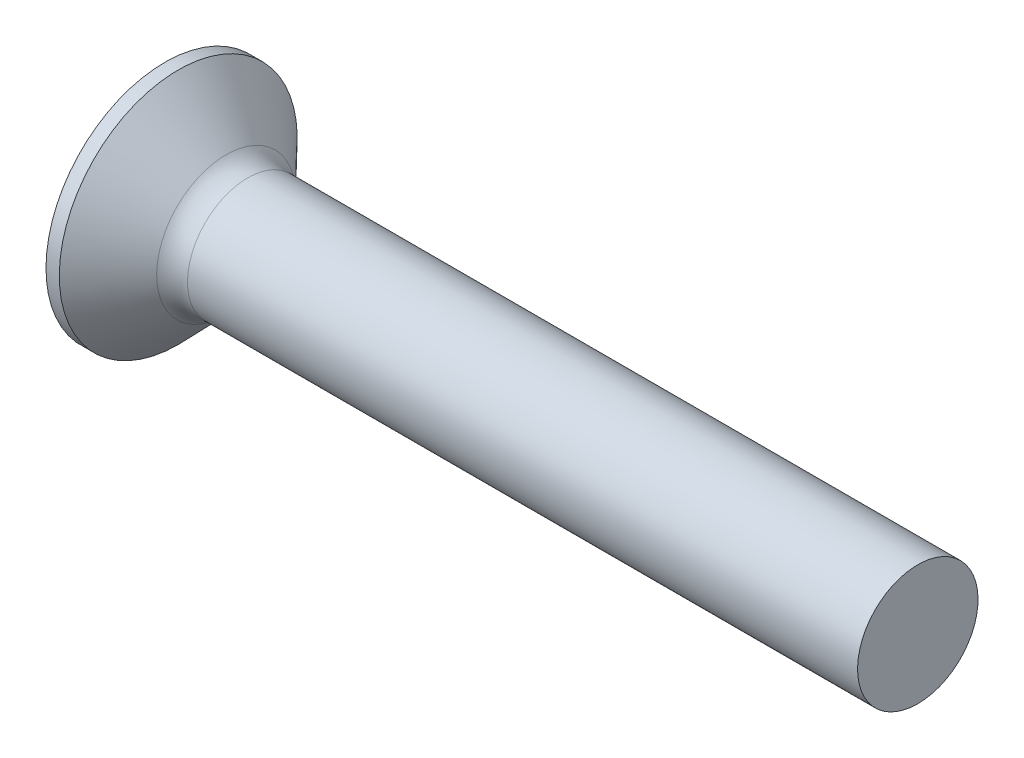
ISO-10303-21;
HEADER;
FILE_DESCRIPTION(('STEP AP214'),'2;1');
FILE_NAME('part.step','',(''),(''),'','','');
FILE_SCHEMA(('AUTOMOTIVE_DESIGN { 1 0 10303 214 1 1 1 1 }'));
ENDSEC;
DATA;
#1=APPLICATION_CONTEXT('core data for automotive mechanical design processes');
#2=APPLICATION_PROTOCOL_DEFINITION('international standard','automotive_design',2000,#1);
#3=PRODUCT_CONTEXT('',#1,'mechanical');
#4=PRODUCT('Part','Part','',(#3));
#5=PRODUCT_RELATED_PRODUCT_CATEGORY('part','',(#4));
#6=PRODUCT_DEFINITION_FORMATION('','',#4);
#7=PRODUCT_DEFINITION_CONTEXT('part definition',#1,'design');
#8=PRODUCT_DEFINITION('design','',#6,#7);
#9=PRODUCT_DEFINITION_SHAPE('','',#8);
#10=(LENGTH_UNIT() NAMED_UNIT(*) SI_UNIT(.MILLI.,.METRE.));
#11=(NAMED_UNIT(*) PLANE_ANGLE_UNIT() SI_UNIT($,.RADIAN.));
#12=(NAMED_UNIT(*) SI_UNIT($,.STERADIAN.) SOLID_ANGLE_UNIT());
#13=UNCERTAINTY_MEASURE_WITH_UNIT(LENGTH_MEASURE(1.E-05),#10,'distance_accuracy_value','');
#14=(GEOMETRIC_REPRESENTATION_CONTEXT(3) GLOBAL_UNCERTAINTY_ASSIGNED_CONTEXT((#13)) GLOBAL_UNIT_ASSIGNED_CONTEXT((#10,
#11,#12)) REPRESENTATION_CONTEXT('',''));
#15=CARTESIAN_POINT('',(0.,0.,0.));
#16=DIRECTION('',(0.,0.,1.));
#17=DIRECTION('',(1.,0.,0.));
#18=AXIS2_PLACEMENT_3D('',#15,#16,#17);
#19=CARTESIAN_POINT('',(16.5,0.,0.));
#20=DIRECTION('',(-1.,0.,0.));
#21=DIRECTION('',(0.,1.,0.));
#22=AXIS2_PLACEMENT_3D('',#19,#20,#21);
#23=SPHERICAL_SURFACE('',#22,16.5);
#24=CARTESIAN_POINT('',(2.01414483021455,0.,0.));
#25=DIRECTION('',(-1.,0.,0.));
#26=DIRECTION('',(0.,-1.,0.));
#27=AXIS2_PLACEMENT_3D('',#24,#25,#26);
#28=CIRCLE('',#27,7.9);
#29=CARTESIAN_POINT('',(2.01414483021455,-7.9,0.));
#30=VERTEX_POINT('',#29);
#31=EDGE_CURVE('E709',#30,#30,#28,.T.);
#32=ORIENTED_EDGE('',*,*,#31,.T.);
#33=EDGE_LOOP('',(#32));
#34=FACE_BOUND('',#33,.T.);
#35=CARTESIAN_POINT('',(0.130621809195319,0.,0.));
#36=DIRECTION('',(1.,0.,0.));
#37=DIRECTION('',(0.,0.,-1.));
#38=AXIS2_PLACEMENT_3D('',#35,#36,#37);
#39=CIRCLE('',#38,2.07206603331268);
#40=CARTESIAN_POINT('',(0.130621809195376,-0.945999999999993,-1.84351339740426));
#41=VERTEX_POINT('',#40);
#42=CARTESIAN_POINT('',(0.130621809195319,-1.84351339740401,-0.946));
#43=VERTEX_POINT('',#42);
#44=EDGE_CURVE('E486',#41,#43,#39,.F.);
#45=ORIENTED_EDGE('',*,*,#44,.F.);
#46=CARTESIAN_POINT('',(16.5,-0.946,0.));
#47=DIRECTION('',(0.,1.,0.));
#48=DIRECTION('',(0.,0.,1.));
#49=AXIS2_PLACEMENT_3D('',#46,#47,#48);
#50=CIRCLE('',#49,16.4728590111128);
#51=CARTESIAN_POINT('',(0.529252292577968,-0.945999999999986,-4.0361245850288));
#52=VERTEX_POINT('',#51);
#53=EDGE_CURVE('E683',#52,#41,#50,.T.);
#54=ORIENTED_EDGE('',*,*,#53,.F.);
#55=CARTESIAN_POINT('',(14.932040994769,0.,3.14483976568));
#56=DIRECTION('',(-0.446197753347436,0.,0.894934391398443));
#57=DIRECTION('',(0.894934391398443,0.,0.446197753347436));
#58=AXIS2_PLACEMENT_3D('',#55,#56,#57);
#59=CIRCLE('',#58,16.1214604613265);
#60=CARTESIAN_POINT('',(0.529252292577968,0.946000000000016,-4.03612458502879));
#61=VERTEX_POINT('',#60);
#62=EDGE_CURVE('E61',#61,#52,#59,.T.);
#63=ORIENTED_EDGE('',*,*,#62,.F.);
#64=CARTESIAN_POINT('',(16.5,0.945999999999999,0.));
#65=DIRECTION('',(0.,-1.,0.));
#66=DIRECTION('',(0.,0.,-1.));
#67=AXIS2_PLACEMENT_3D('',#64,#65,#66);
#68=CIRCLE('',#67,16.4728590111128);
#69=CARTESIAN_POINT('',(0.130621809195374,0.946000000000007,-1.84351339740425));
#70=VERTEX_POINT('',#69);
#71=EDGE_CURVE('E594',#70,#61,#68,.T.);
#72=ORIENTED_EDGE('',*,*,#71,.F.);
#73=CARTESIAN_POINT('',(0.130621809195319,1.84351339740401,-0.946));
#74=VERTEX_POINT('',#73);
#75=EDGE_CURVE('E739',#74,#70,#39,.F.);
#76=ORIENTED_EDGE('',*,*,#75,.F.);
#77=CARTESIAN_POINT('',(16.5,0.,-0.945999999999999));
#78=DIRECTION('',(0.,0.,1.));
#79=DIRECTION('',(0.,-1.,0.));
#80=AXIS2_PLACEMENT_3D('',#77,#78,#79);
#81=CIRCLE('',#80,16.4728590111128);
#82=CARTESIAN_POINT('',(0.529252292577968,4.03612458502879,-0.945999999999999));
#83=VERTEX_POINT('',#82);
#84=EDGE_CURVE('E720',#83,#74,#81,.T.);
#85=ORIENTED_EDGE('',*,*,#84,.F.);
#86=CARTESIAN_POINT('',(14.932040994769,-3.14483976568,0.));
#87=DIRECTION('',(-0.446197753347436,-0.894934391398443,0.));
#88=DIRECTION('',(0.894934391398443,-0.446197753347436,0.));
#89=AXIS2_PLACEMENT_3D('',#86,#87,#88);
#90=CIRCLE('',#89,16.1214604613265);
#91=CARTESIAN_POINT('',(0.529252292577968,4.03612458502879,0.946));
#92=VERTEX_POINT('',#91);
#93=EDGE_CURVE('E717',#92,#83,#90,.T.);
#94=ORIENTED_EDGE('',*,*,#93,.F.);
#95=CARTESIAN_POINT('',(16.5,0.,0.946));
#96=DIRECTION('',(0.,0.,-1.));
#97=DIRECTION('',(0.,1.,0.));
#98=AXIS2_PLACEMENT_3D('',#95,#96,#97);
#99=CIRCLE('',#98,16.4728590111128);
#100=CARTESIAN_POINT('',(0.130621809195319,1.84351339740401,0.946));
#101=VERTEX_POINT('',#100);
#102=EDGE_CURVE('E77',#101,#92,#99,.T.);
#103=ORIENTED_EDGE('',*,*,#102,.F.);
#104=CARTESIAN_POINT('',(0.130621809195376,0.945999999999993,1.84351339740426));
#105=VERTEX_POINT('',#104);
#106=EDGE_CURVE('E485',#105,#101,#39,.F.);
#107=ORIENTED_EDGE('',*,*,#106,.F.);
#108=CARTESIAN_POINT('',(0.529252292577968,0.945999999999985,4.0361245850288));
#109=VERTEX_POINT('',#108);
#110=EDGE_CURVE('E687',#109,#105,#68,.T.);
#111=ORIENTED_EDGE('',*,*,#110,.F.);
#112=CARTESIAN_POINT('',(14.932040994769,0.,-3.14483976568));
#113=DIRECTION('',(-0.446197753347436,0.,-0.894934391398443));
#114=DIRECTION('',(-0.894934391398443,0.,0.446197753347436));
#115=AXIS2_PLACEMENT_3D('',#112,#113,#114);
#116=CIRCLE('',#115,16.1214604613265);
#117=CARTESIAN_POINT('',(0.529252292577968,-0.946000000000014,4.03612458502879));
#118=VERTEX_POINT('',#117);
#119=EDGE_CURVE('E679',#118,#109,#116,.T.);
#120=ORIENTED_EDGE('',*,*,#119,.F.);
#121=CARTESIAN_POINT('',(0.130621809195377,-0.946000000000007,1.84351339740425));
#122=VERTEX_POINT('',#121);
#123=EDGE_CURVE('E686',#122,#118,#50,.T.);
#124=ORIENTED_EDGE('',*,*,#123,.F.);
#125=CARTESIAN_POINT('',(0.130621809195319,-1.84351339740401,0.946));
#126=VERTEX_POINT('',#125);
#127=EDGE_CURVE('E480',#126,#122,#39,.F.);
#128=ORIENTED_EDGE('',*,*,#127,.F.);
#129=CARTESIAN_POINT('',(0.529252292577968,-4.03612458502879,0.946));
#130=VERTEX_POINT('',#129);
#131=EDGE_CURVE('E723',#130,#126,#99,.T.);
#132=ORIENTED_EDGE('',*,*,#131,.F.);
#133=CARTESIAN_POINT('',(14.932040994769,3.14483976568,0.));
#134=DIRECTION('',(-0.446197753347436,0.894934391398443,0.));
#135=DIRECTION('',(-0.894934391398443,-0.446197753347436,0.));
#136=AXIS2_PLACEMENT_3D('',#133,#134,#135);
#137=CIRCLE('',#136,16.1214604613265);
#138=CARTESIAN_POINT('',(0.529252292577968,-4.03612458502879,-0.946000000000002));
#139=VERTEX_POINT('',#138);
#140=EDGE_CURVE('E725',#139,#130,#137,.T.);
#141=ORIENTED_EDGE('',*,*,#140,.F.);
#142=EDGE_CURVE('E719',#43,#139,#81,.T.);
#143=ORIENTED_EDGE('',*,*,#142,.F.);
#144=EDGE_LOOP('',(#45,#54,#63,#72,#76,#85,#94,#103,#107,#111,#120,#124,#128,#132,#141,#143));
#145=FACE_BOUND('',#144,.T.);
#146=ADVANCED_FACE('F51',(#34,#145),#23,.T.);
#147=CARTESIAN_POINT('',(0.,-4.3,0.946));
#148=DIRECTION('',(0.,0.,-1.));
#149=DIRECTION('',(0.,1.,0.));
#150=AXIS2_PLACEMENT_3D('',#147,#148,#149);
#151=PLANE('',#150);
#152=ORIENTED_EDGE('',*,*,#131,.T.);
#153=CARTESIAN_POINT('',(0.0541017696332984,-1.84952553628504,0.946));
#154=CARTESIAN_POINT('',(0.699431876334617,-1.7988175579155,0.946));
#155=CARTESIAN_POINT('',(1.34473222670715,-1.7477208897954,0.946));
#156=CARTESIAN_POINT('',(2.63524109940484,-1.64440464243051,0.946));
#157=CARTESIAN_POINT('',(3.28044962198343,-1.59218506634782,0.946));
#158=CARTESIAN_POINT('',(4.13471195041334,-1.52206699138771,0.946));
#159=CARTESIAN_POINT('',(4.34381968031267,-1.50482570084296,0.946));
#160=CARTESIAN_POINT('',(4.76202095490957,-1.47016967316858,0.946));
#161=CARTESIAN_POINT('',(4.97111449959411,-1.45275493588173,0.946));
#162=CARTESIAN_POINT('',(5.1802,-1.43524392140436,0.946));
#163=B_SPLINE_CURVE_WITH_KNOTS('',3,(#153,#154,#155,#156,#157,#158,#159,#160,#161,#162),
.UNSPECIFIED.,.F.,.F.,(4,2,2,2,4),(0.,1.94195898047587,3.8839124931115,4.51336436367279,
5.14281680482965),.UNSPECIFIED.);
#164=CARTESIAN_POINT('',(5.18,-1.43526067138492,0.946));
#165=VERTEX_POINT('',#164);
#166=EDGE_CURVE('E478',#126,#165,#163,.T.);
#167=ORIENTED_EDGE('',*,*,#166,.T.);
#168=DIRECTION('',(0.,-1.,0.));
#169=VECTOR('',#168,1.);
#170=CARTESIAN_POINT('',(5.18,1.71734770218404,0.946));
#171=LINE('',#170,#169);
#172=CARTESIAN_POINT('',(5.18,-1.71734770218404,0.946));
#173=VERTEX_POINT('',#172);
#174=EDGE_CURVE('E430',#165,#173,#171,.T.);
#175=ORIENTED_EDGE('',*,*,#174,.T.);
#176=DIRECTION('',(0.894934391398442,0.446197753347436,0.));
#177=VECTOR('',#176,1.);
#178=CARTESIAN_POINT('',(0.,-4.3,0.946));
#179=LINE('',#178,#177);
#180=EDGE_CURVE('E699',#130,#173,#179,.T.);
#181=ORIENTED_EDGE('',*,*,#180,.F.);
#182=EDGE_LOOP('',(#152,#167,#175,#181));
#183=FACE_BOUND('',#182,.T.);
#184=ADVANCED_FACE('F208',(#183),#151,.T.);
#185=CARTESIAN_POINT('',(5.18,1.71734770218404,0.946));
#186=VERTEX_POINT('',#185);
#187=CARTESIAN_POINT('',(5.18,1.43526067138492,0.946));
#188=VERTEX_POINT('',#187);
#189=EDGE_CURVE('E445',#186,#188,#171,.T.);
#190=ORIENTED_EDGE('',*,*,#189,.T.);
#191=CARTESIAN_POINT('',(5.1802,1.43524392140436,0.946));
#192=CARTESIAN_POINT('',(4.64644015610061,1.47993054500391,0.946));
#193=CARTESIAN_POINT('',(4.11263086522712,1.52402131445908,0.946));
#194=CARTESIAN_POINT('',(3.04493385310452,1.61123082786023,0.946));
#195=CARTESIAN_POINT('',(2.51104613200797,1.65434957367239,0.946));
#196=CARTESIAN_POINT('',(1.656644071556,1.72274853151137,0.946));
#197=CARTESIAN_POINT('',(1.33614892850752,1.74826932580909,0.946));
#198=CARTESIAN_POINT('',(0.695139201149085,1.79907030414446,0.946));
#199=CARTESIAN_POINT('',(0.374624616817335,1.824350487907,0.946));
#200=CARTESIAN_POINT('',(0.0541017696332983,1.84952553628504,0.946));
#201=B_SPLINE_CURVE_WITH_KNOTS('',3,(#191,#192,#193,#194,#195,#196,#197,#198,#199,#200),
.UNSPECIFIED.,.F.,.F.,(4,2,2,2,4),(0.,1.60688056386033,3.21375804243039,4.1782868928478,
5.14281684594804),.UNSPECIFIED.);
#202=EDGE_CURVE('E746',#188,#101,#201,.T.);
#203=ORIENTED_EDGE('',*,*,#202,.T.);
#204=ORIENTED_EDGE('',*,*,#102,.T.);
#205=DIRECTION('',(0.894934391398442,-0.446197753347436,0.));
#206=VECTOR('',#205,1.);
#207=CARTESIAN_POINT('',(0.,4.3,0.946));
#208=LINE('',#207,#206);
#209=EDGE_CURVE('E697',#92,#186,#208,.T.);
#210=ORIENTED_EDGE('',*,*,#209,.T.);
#211=EDGE_LOOP('',(#190,#203,#204,#210));
#212=FACE_BOUND('',#211,.T.);
#213=ADVANCED_FACE('F213',(#212),#151,.T.);
#214=CARTESIAN_POINT('',(0.,4.3,-0.945999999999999));
#215=DIRECTION('',(0.,0.,1.));
#216=DIRECTION('',(0.,-1.,0.));
#217=AXIS2_PLACEMENT_3D('',#214,#215,#216);
#218=PLANE('',#217);
#219=DIRECTION('',(0.,1.,0.));
#220=VECTOR('',#219,1.);
#221=CARTESIAN_POINT('',(5.18,1.71734770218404,-0.945999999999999));
#222=LINE('',#221,#220);
#223=CARTESIAN_POINT('',(5.18,-1.71734770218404,-0.945999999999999));
#224=VERTEX_POINT('',#223);
#225=CARTESIAN_POINT('',(5.18,-1.43526067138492,-0.945999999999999));
#226=VERTEX_POINT('',#225);
#227=EDGE_CURVE('E632',#224,#226,#222,.T.);
#228=ORIENTED_EDGE('',*,*,#227,.T.);
#229=CARTESIAN_POINT('',(5.1802,-1.43524392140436,-0.946));
#230=CARTESIAN_POINT('',(4.64644015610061,-1.47993054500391,-0.946));
#231=CARTESIAN_POINT('',(4.11263086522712,-1.52402131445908,-0.946));
#232=CARTESIAN_POINT('',(3.04493385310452,-1.61123082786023,-0.946));
#233=CARTESIAN_POINT('',(2.51104613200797,-1.65434957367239,-0.946));
#234=CARTESIAN_POINT('',(1.656644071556,-1.72274853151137,-0.946));
#235=CARTESIAN_POINT('',(1.33614892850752,-1.74826932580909,-0.946));
#236=CARTESIAN_POINT('',(0.695139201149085,-1.79907030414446,-0.946));
#237=CARTESIAN_POINT('',(0.374624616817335,-1.824350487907,-0.946));
#238=CARTESIAN_POINT('',(0.0541017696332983,-1.84952553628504,-0.946));
#239=B_SPLINE_CURVE_WITH_KNOTS('',3,(#229,#230,#231,#232,#233,#234,#235,#236,#237,#238),
.UNSPECIFIED.,.F.,.F.,(4,2,2,2,4),(0.,1.60688056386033,3.21375804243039,4.1782868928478,
5.14281684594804),.UNSPECIFIED.);
#240=EDGE_CURVE('E509',#226,#43,#239,.T.);
#241=ORIENTED_EDGE('',*,*,#240,.T.);
#242=ORIENTED_EDGE('',*,*,#142,.T.);
#243=DIRECTION('',(0.894934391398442,0.446197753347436,0.));
#244=VECTOR('',#243,1.);
#245=CARTESIAN_POINT('',(0.,-4.3,-0.946000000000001));
#246=LINE('',#245,#244);
#247=EDGE_CURVE('E696',#139,#224,#246,.T.);
#248=ORIENTED_EDGE('',*,*,#247,.T.);
#249=EDGE_LOOP('',(#228,#241,#242,#248));
#250=FACE_BOUND('',#249,.T.);
#251=ADVANCED_FACE('F520',(#250),#218,.T.);
#252=ORIENTED_EDGE('',*,*,#84,.T.);
#253=CARTESIAN_POINT('',(0.0541017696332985,1.84952553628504,-0.946));
#254=CARTESIAN_POINT('',(0.699431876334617,1.7988175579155,-0.946));
#255=CARTESIAN_POINT('',(1.34473222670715,1.7477208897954,-0.946));
#256=CARTESIAN_POINT('',(2.63524109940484,1.64440464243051,-0.946));
#257=CARTESIAN_POINT('',(3.28044962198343,1.59218506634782,-0.946));
#258=CARTESIAN_POINT('',(4.13471195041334,1.52206699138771,-0.946));
#259=CARTESIAN_POINT('',(4.34381968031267,1.50482570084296,-0.946));
#260=CARTESIAN_POINT('',(4.76202095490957,1.47016967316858,-0.946));
#261=CARTESIAN_POINT('',(4.97111449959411,1.45275493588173,-0.946));
#262=CARTESIAN_POINT('',(5.1802,1.43524392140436,-0.945999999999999));
#263=B_SPLINE_CURVE_WITH_KNOTS('',3,(#253,#254,#255,#256,#257,#258,#259,#260,#261,#262),
.UNSPECIFIED.,.F.,.F.,(4,2,2,2,4),(0.,1.94195898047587,3.8839124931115,4.51336436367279,
5.14281680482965),.UNSPECIFIED.);
#264=CARTESIAN_POINT('',(5.18,1.43526067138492,-0.945999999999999));
#265=VERTEX_POINT('',#264);
#266=EDGE_CURVE('E536',#74,#265,#263,.T.);
#267=ORIENTED_EDGE('',*,*,#266,.T.);
#268=CARTESIAN_POINT('',(5.18,1.71734770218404,-0.945999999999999));
#269=VERTEX_POINT('',#268);
#270=EDGE_CURVE('E634',#265,#269,#222,.T.);
#271=ORIENTED_EDGE('',*,*,#270,.T.);
#272=DIRECTION('',(0.894934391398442,-0.446197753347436,0.));
#273=VECTOR('',#272,1.);
#274=CARTESIAN_POINT('',(0.,4.3,-0.945999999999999));
#275=LINE('',#274,#273);
#276=EDGE_CURVE('E693',#83,#269,#275,.T.);
#277=ORIENTED_EDGE('',*,*,#276,.F.);
#278=EDGE_LOOP('',(#252,#267,#271,#277));
#279=FACE_BOUND('',#278,.T.);
#280=ADVANCED_FACE('F396',(#279),#218,.T.);
#281=CARTESIAN_POINT('',(0.,-4.3,-0.946));
#282=DIRECTION('',(-0.446197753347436,0.894934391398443,0.));
#283=DIRECTION('',(-0.894934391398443,-0.446197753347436,0.));
#284=AXIS2_PLACEMENT_3D('',#281,#282,#283);
#285=PLANE('',#284);
#286=DIRECTION('',(0.,0.,-1.));
#287=VECTOR('',#286,1.);
#288=CARTESIAN_POINT('',(5.18,-1.71734770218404,0.946));
#289=LINE('',#288,#287);
#290=CARTESIAN_POINT('',(5.18,-1.71734770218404,0.0748736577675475));
#291=VERTEX_POINT('',#290);
#292=EDGE_CURVE('E642',#173,#291,#289,.T.);
#293=ORIENTED_EDGE('',*,*,#292,.T.);
#294=CARTESIAN_POINT('',(5.18,0.,0.));
#295=DIRECTION('',(-1.,0.,0.));
#296=DIRECTION('',(0.,-0.999050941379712,-0.0435570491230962));
#297=AXIS2_PLACEMENT_3D('',#294,#295,#296);
#298=CIRCLE('',#297,1.71897911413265);
#299=CARTESIAN_POINT('',(5.18,-1.71734770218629,-0.0748736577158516));
#300=VERTEX_POINT('',#299);
#301=EDGE_CURVE('E378',#300,#291,#298,.T.);
#302=ORIENTED_EDGE('',*,*,#301,.F.);
#303=EDGE_CURVE('E418',#300,#224,#289,.T.);
#304=ORIENTED_EDGE('',*,*,#303,.T.);
#305=ORIENTED_EDGE('',*,*,#247,.F.);
#306=ORIENTED_EDGE('',*,*,#140,.T.);
#307=ORIENTED_EDGE('',*,*,#180,.T.);
#308=EDGE_LOOP('',(#293,#302,#304,#305,#306,#307));
#309=FACE_BOUND('',#308,.T.);
#310=ADVANCED_FACE('F387',(#309),#285,.T.);
#311=CARTESIAN_POINT('',(5.18,1.71734770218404,0.946));
#312=DIRECTION('',(-0.446197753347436,-0.894934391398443,0.));
#313=DIRECTION('',(0.894934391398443,-0.446197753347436,0.));
#314=AXIS2_PLACEMENT_3D('',#311,#312,#313);
#315=PLANE('',#314);
#316=DIRECTION('',(0.,0.,1.));
#317=VECTOR('',#316,1.);
#318=CARTESIAN_POINT('',(5.18,1.71734770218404,0.946));
#319=LINE('',#318,#317);
#320=CARTESIAN_POINT('',(5.18,1.71734770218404,-0.0748736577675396));
#321=VERTEX_POINT('',#320);
#322=EDGE_CURVE('E643',#269,#321,#319,.T.);
#323=ORIENTED_EDGE('',*,*,#322,.T.);
#324=CARTESIAN_POINT('',(5.18,0.,0.));
#325=DIRECTION('',(-1.,0.,0.));
#326=DIRECTION('',(0.,0.999050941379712,0.0435570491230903));
#327=AXIS2_PLACEMENT_3D('',#324,#325,#326);
#328=CIRCLE('',#327,1.71897911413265);
#329=CARTESIAN_POINT('',(5.18,1.71734770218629,0.0748736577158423));
#330=VERTEX_POINT('',#329);
#331=EDGE_CURVE('E364',#330,#321,#328,.T.);
#332=ORIENTED_EDGE('',*,*,#331,.F.);
#333=EDGE_CURVE('E457',#330,#186,#319,.T.);
#334=ORIENTED_EDGE('',*,*,#333,.T.);
#335=ORIENTED_EDGE('',*,*,#209,.F.);
#336=ORIENTED_EDGE('',*,*,#93,.T.);
#337=ORIENTED_EDGE('',*,*,#276,.T.);
#338=EDGE_LOOP('',(#323,#332,#334,#335,#336,#337));
#339=FACE_BOUND('',#338,.T.);
#340=ADVANCED_FACE('F241',(#339),#315,.T.);
#341=CARTESIAN_POINT('',(5.18,1.71734770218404,0.946));
#342=DIRECTION('',(1.,0.,0.));
#343=DIRECTION('',(0.,0.,-1.));
#344=AXIS2_PLACEMENT_3D('',#341,#342,#343);
#345=PLANE('',#344);
#346=CARTESIAN_POINT('',(5.18,0.,0.));
#347=DIRECTION('',(-1.,0.,0.));
#348=DIRECTION('',(0.,0.,1.));
#349=AXIS2_PLACEMENT_3D('',#346,#347,#348);
#350=CIRCLE('',#349,1.71897911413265);
#351=CARTESIAN_POINT('',(5.18,-0.0748736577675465,-1.71734770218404));
#352=VERTEX_POINT('',#351);
#353=CARTESIAN_POINT('',(5.18,-0.945999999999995,-1.43526067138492));
#354=VERTEX_POINT('',#353);
#355=EDGE_CURVE('E771',#352,#354,#350,.T.);
#356=ORIENTED_EDGE('',*,*,#355,.F.);
#357=DIRECTION('',(0.,1.,0.));
#358=VECTOR('',#357,1.);
#359=CARTESIAN_POINT('',(5.18,-0.945999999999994,-1.71734770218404));
#360=LINE('',#359,#358);
#361=CARTESIAN_POINT('',(5.18,-0.945999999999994,-1.71734770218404));
#362=VERTEX_POINT('',#361);
#363=EDGE_CURVE('E622',#362,#352,#360,.T.);
#364=ORIENTED_EDGE('',*,*,#363,.F.);
#365=DIRECTION('',(0.,0.,-1.));
#366=VECTOR('',#365,1.);
#367=CARTESIAN_POINT('',(5.18,-0.946000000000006,1.71734770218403));
#368=LINE('',#367,#366);
#369=EDGE_CURVE('E620',#354,#362,#368,.T.);
#370=ORIENTED_EDGE('',*,*,#369,.F.);
#371=EDGE_LOOP('',(#356,#364,#370));
#372=FACE_BOUND('',#371,.T.);
#373=ADVANCED_FACE('F236',(#372),#345,.F.);
#374=EDGE_CURVE('E777',#226,#300,#350,.T.);
#375=ORIENTED_EDGE('',*,*,#374,.F.);
#376=ORIENTED_EDGE('',*,*,#227,.F.);
#377=ORIENTED_EDGE('',*,*,#303,.F.);
#378=EDGE_LOOP('',(#375,#376,#377));
#379=FACE_BOUND('',#378,.T.);
#380=ADVANCED_FACE('F240',(#379),#345,.F.);
#381=EDGE_CURVE('E779',#291,#165,#350,.T.);
#382=ORIENTED_EDGE('',*,*,#381,.F.);
#383=ORIENTED_EDGE('',*,*,#292,.F.);
#384=ORIENTED_EDGE('',*,*,#174,.F.);
#385=EDGE_LOOP('',(#382,#383,#384));
#386=FACE_BOUND('',#385,.T.);
#387=ADVANCED_FACE('F786',(#386),#345,.F.);
#388=CARTESIAN_POINT('',(5.18,-0.946000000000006,1.43526067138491));
#389=VERTEX_POINT('',#388);
#390=CARTESIAN_POINT('',(5.18,-0.0748736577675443,1.71734770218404));
#391=VERTEX_POINT('',#390);
#392=EDGE_CURVE('E783',#389,#391,#350,.T.);
#393=ORIENTED_EDGE('',*,*,#392,.F.);
#394=CARTESIAN_POINT('',(5.18,-0.946000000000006,1.71734770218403));
#395=VERTEX_POINT('',#394);
#396=EDGE_CURVE('E610',#395,#389,#368,.T.);
#397=ORIENTED_EDGE('',*,*,#396,.F.);
#398=DIRECTION('',(0.,-1.,0.));
#399=VECTOR('',#398,1.);
#400=CARTESIAN_POINT('',(5.18,-0.946000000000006,1.71734770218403));
#401=LINE('',#400,#399);
#402=EDGE_CURVE('E311',#391,#395,#401,.T.);
#403=ORIENTED_EDGE('',*,*,#402,.F.);
#404=EDGE_LOOP('',(#393,#397,#403));
#405=FACE_BOUND('',#404,.T.);
#406=ADVANCED_FACE('F784',(#405),#345,.F.);
#407=CARTESIAN_POINT('',(5.18,0.0748736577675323,1.71734770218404));
#408=VERTEX_POINT('',#407);
#409=CARTESIAN_POINT('',(5.18,0.945999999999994,1.43526067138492));
#410=VERTEX_POINT('',#409);
#411=EDGE_CURVE('E69',#408,#410,#350,.T.);
#412=ORIENTED_EDGE('',*,*,#411,.F.);
#413=CARTESIAN_POINT('',(5.18,0.945999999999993,1.71734770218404));
#414=VERTEX_POINT('',#413);
#415=EDGE_CURVE('E55',#414,#408,#401,.T.);
#416=ORIENTED_EDGE('',*,*,#415,.F.);
#417=DIRECTION('',(0.,0.,1.));
#418=VECTOR('',#417,1.);
#419=CARTESIAN_POINT('',(5.18,0.945999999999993,1.71734770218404));
#420=LINE('',#419,#418);
#421=EDGE_CURVE('E384',#410,#414,#420,.T.);
#422=ORIENTED_EDGE('',*,*,#421,.F.);
#423=EDGE_LOOP('',(#412,#416,#422));
#424=FACE_BOUND('',#423,.T.);
#425=ADVANCED_FACE('F680',(#424),#345,.F.);
#426=EDGE_CURVE('E750',#188,#330,#350,.T.);
#427=ORIENTED_EDGE('',*,*,#426,.F.);
#428=ORIENTED_EDGE('',*,*,#189,.F.);
#429=ORIENTED_EDGE('',*,*,#333,.F.);
#430=EDGE_LOOP('',(#427,#428,#429));
#431=FACE_BOUND('',#430,.T.);
#432=ADVANCED_FACE('F791',(#431),#345,.F.);
#433=EDGE_CURVE('E762',#321,#265,#350,.T.);
#434=ORIENTED_EDGE('',*,*,#433,.F.);
#435=ORIENTED_EDGE('',*,*,#322,.F.);
#436=ORIENTED_EDGE('',*,*,#270,.F.);
#437=EDGE_LOOP('',(#434,#435,#436));
#438=FACE_BOUND('',#437,.T.);
#439=ADVANCED_FACE('F826',(#438),#345,.F.);
#440=CARTESIAN_POINT('',(5.18,0.946000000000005,-1.43526067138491));
#441=VERTEX_POINT('',#440);
#442=CARTESIAN_POINT('',(5.18,0.0748736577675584,-1.71734770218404));
#443=VERTEX_POINT('',#442);
#444=EDGE_CURVE('E768',#441,#443,#350,.T.);
#445=ORIENTED_EDGE('',*,*,#444,.F.);
#446=CARTESIAN_POINT('',(5.18,0.946000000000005,-1.71734770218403));
#447=VERTEX_POINT('',#446);
#448=EDGE_CURVE('E645',#447,#441,#420,.T.);
#449=ORIENTED_EDGE('',*,*,#448,.F.);
#450=EDGE_CURVE('E320',#443,#447,#360,.T.);
#451=ORIENTED_EDGE('',*,*,#450,.F.);
#452=EDGE_LOOP('',(#445,#449,#451));
#453=FACE_BOUND('',#452,.T.);
#454=ADVANCED_FACE('F243',(#453),#345,.F.);
#455=CARTESIAN_POINT('',(0.,0.945999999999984,4.3));
#456=DIRECTION('',(0.,-1.,0.));
#457=DIRECTION('',(0.,0.,-1.));
#458=AXIS2_PLACEMENT_3D('',#455,#456,#457);
#459=PLANE('',#458);
#460=ORIENTED_EDGE('',*,*,#448,.T.);
#461=CARTESIAN_POINT('',(5.1802,0.946000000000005,-1.43524392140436));
#462=CARTESIAN_POINT('',(4.64644015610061,0.946000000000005,-1.47993054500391));
#463=CARTESIAN_POINT('',(4.11263086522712,0.946000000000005,-1.52402131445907));
#464=CARTESIAN_POINT('',(3.04493385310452,0.946000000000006,-1.61123082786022));
#465=CARTESIAN_POINT('',(2.51104613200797,0.946000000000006,-1.65434957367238));
#466=CARTESIAN_POINT('',(1.656644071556,0.946000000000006,-1.72274853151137));
#467=CARTESIAN_POINT('',(1.33614892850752,0.946000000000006,-1.74826932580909));
#468=CARTESIAN_POINT('',(0.695139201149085,0.946000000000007,-1.79907030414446));
#469=CARTESIAN_POINT('',(0.374624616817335,0.946000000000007,-1.824350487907));
#470=CARTESIAN_POINT('',(0.0541017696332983,0.946000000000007,-1.84952553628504));
#471=B_SPLINE_CURVE_WITH_KNOTS('',3,(#461,#462,#463,#464,#465,#466,#467,#468,#469,#470),
.UNSPECIFIED.,.F.,.F.,(4,2,2,2,4),(0.,1.60688056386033,3.21375804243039,4.1782868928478,
5.14281684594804),.UNSPECIFIED.);
#472=EDGE_CURVE('E512',#441,#70,#471,.T.);
#473=ORIENTED_EDGE('',*,*,#472,.T.);
#474=ORIENTED_EDGE('',*,*,#71,.T.);
#475=DIRECTION('',(0.894934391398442,0.,0.446197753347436));
#476=VECTOR('',#475,1.);
#477=CARTESIAN_POINT('',(0.,0.946000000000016,-4.3));
#478=LINE('',#477,#476);
#479=EDGE_CURVE('E587',#61,#447,#478,.T.);
#480=ORIENTED_EDGE('',*,*,#479,.T.);
#481=EDGE_LOOP('',(#460,#473,#474,#480));
#482=FACE_BOUND('',#481,.T.);
#483=ADVANCED_FACE('F650',(#482),#459,.T.);
#484=CARTESIAN_POINT('',(0.,-0.945999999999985,-4.3));
#485=DIRECTION('',(0.,1.,0.));
#486=DIRECTION('',(0.,0.,1.));
#487=AXIS2_PLACEMENT_3D('',#484,#485,#486);
#488=PLANE('',#487);
#489=ORIENTED_EDGE('',*,*,#53,.T.);
#490=CARTESIAN_POINT('',(0.0541017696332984,-0.945999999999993,-1.84952553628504));
#491=CARTESIAN_POINT('',(0.699431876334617,-0.945999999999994,-1.7988175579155));
#492=CARTESIAN_POINT('',(1.34473222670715,-0.945999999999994,-1.7477208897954));
#493=CARTESIAN_POINT('',(2.63524109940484,-0.945999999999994,-1.64440464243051));
#494=CARTESIAN_POINT('',(3.28044962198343,-0.945999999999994,-1.59218506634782));
#495=CARTESIAN_POINT('',(4.13471195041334,-0.945999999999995,-1.52206699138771));
#496=CARTESIAN_POINT('',(4.34381968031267,-0.945999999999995,-1.50482570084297));
#497=CARTESIAN_POINT('',(4.76202095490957,-0.945999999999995,-1.47016967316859));
#498=CARTESIAN_POINT('',(4.97111449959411,-0.945999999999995,-1.45275493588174));
#499=CARTESIAN_POINT('',(5.1802,-0.945999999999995,-1.43524392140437));
#500=B_SPLINE_CURVE_WITH_KNOTS('',3,(#490,#491,#492,#493,#494,#495,#496,#497,#498,#499),
.UNSPECIFIED.,.F.,.F.,(4,2,2,2,4),(0.,1.94195898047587,3.8839124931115,4.51336436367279,
5.14281680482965),.UNSPECIFIED.);
#501=EDGE_CURVE('E479',#41,#354,#500,.T.);
#502=ORIENTED_EDGE('',*,*,#501,.T.);
#503=ORIENTED_EDGE('',*,*,#369,.T.);
#504=DIRECTION('',(0.894934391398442,0.,0.446197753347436));
#505=VECTOR('',#504,1.);
#506=CARTESIAN_POINT('',(0.,-0.945999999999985,-4.3));
#507=LINE('',#506,#505);
#508=EDGE_CURVE('E593',#52,#362,#507,.T.);
#509=ORIENTED_EDGE('',*,*,#508,.F.);
#510=EDGE_LOOP('',(#489,#502,#503,#509));
#511=FACE_BOUND('',#510,.T.);
#512=ADVANCED_FACE('F344',(#511),#488,.T.);
#513=CARTESIAN_POINT('',(0.,0.946000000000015,-4.3));
#514=DIRECTION('',(-0.446197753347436,0.,0.894934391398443));
#515=DIRECTION('',(-0.894934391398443,0.,-0.446197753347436));
#516=AXIS2_PLACEMENT_3D('',#513,#514,#515);
#517=PLANE('',#516);
#518=ORIENTED_EDGE('',*,*,#363,.T.);
#519=CARTESIAN_POINT('',(5.18,0.,0.));
#520=DIRECTION('',(-1.,0.,0.));
#521=DIRECTION('',(0.,0.0435570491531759,-0.9990509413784));
#522=AXIS2_PLACEMENT_3D('',#519,#520,#521);
#523=CIRCLE('',#522,1.71897911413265);
#524=EDGE_CURVE('E477',#443,#352,#523,.T.);
#525=ORIENTED_EDGE('',*,*,#524,.F.);
#526=ORIENTED_EDGE('',*,*,#450,.T.);
#527=ORIENTED_EDGE('',*,*,#479,.F.);
#528=ORIENTED_EDGE('',*,*,#62,.T.);
#529=ORIENTED_EDGE('',*,*,#508,.T.);
#530=EDGE_LOOP('',(#518,#525,#526,#527,#528,#529));
#531=FACE_BOUND('',#530,.T.);
#532=ADVANCED_FACE('F334',(#531),#517,.T.);
#533=CARTESIAN_POINT('',(5.18,-0.946000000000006,1.71734770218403));
#534=DIRECTION('',(-0.446197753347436,0.,-0.894934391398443));
#535=DIRECTION('',(0.894934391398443,0.,-0.446197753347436));
#536=AXIS2_PLACEMENT_3D('',#533,#534,#535);
#537=PLANE('',#536);
#538=ORIENTED_EDGE('',*,*,#415,.T.);
#539=CARTESIAN_POINT('',(5.18,0.,0.));
#540=DIRECTION('',(-1.,0.,0.));
#541=DIRECTION('',(0.,-0.0435570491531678,0.999050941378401));
#542=AXIS2_PLACEMENT_3D('',#539,#540,#541);
#543=CIRCLE('',#542,1.71897911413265);
#544=EDGE_CURVE('E464',#391,#408,#543,.T.);
#545=ORIENTED_EDGE('',*,*,#544,.F.);
#546=ORIENTED_EDGE('',*,*,#402,.T.);
#547=DIRECTION('',(0.894934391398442,0.,-0.446197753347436));
#548=VECTOR('',#547,1.);
#549=CARTESIAN_POINT('',(0.,-0.946000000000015,4.3));
#550=LINE('',#549,#548);
#551=EDGE_CURVE('E588',#118,#395,#550,.T.);
#552=ORIENTED_EDGE('',*,*,#551,.F.);
#553=ORIENTED_EDGE('',*,*,#119,.T.);
#554=DIRECTION('',(0.894934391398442,0.,-0.446197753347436));
#555=VECTOR('',#554,1.);
#556=CARTESIAN_POINT('',(0.,0.945999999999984,4.3));
#557=LINE('',#556,#555);
#558=EDGE_CURVE('E584',#109,#414,#557,.T.);
#559=ORIENTED_EDGE('',*,*,#558,.T.);
#560=EDGE_LOOP('',(#538,#545,#546,#552,#553,#559));
#561=FACE_BOUND('',#560,.T.);
#562=ADVANCED_FACE('F343',(#561),#537,.T.);
#563=ORIENTED_EDGE('',*,*,#396,.T.);
#564=CARTESIAN_POINT('',(5.1802,-0.946000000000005,1.43524392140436));
#565=CARTESIAN_POINT('',(4.64644015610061,-0.946000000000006,1.47993054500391));
#566=CARTESIAN_POINT('',(4.11263086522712,-0.946000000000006,1.52402131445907));
#567=CARTESIAN_POINT('',(3.04493385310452,-0.946000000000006,1.61123082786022));
#568=CARTESIAN_POINT('',(2.51104613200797,-0.946000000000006,1.65434957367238));
#569=CARTESIAN_POINT('',(1.656644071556,-0.946000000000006,1.72274853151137));
#570=CARTESIAN_POINT('',(1.33614892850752,-0.946000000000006,1.74826932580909));
#571=CARTESIAN_POINT('',(0.695139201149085,-0.946000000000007,1.79907030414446));
#572=CARTESIAN_POINT('',(0.374624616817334,-0.946000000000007,1.824350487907));
#573=CARTESIAN_POINT('',(0.0541017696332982,-0.946000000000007,1.84952553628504));
#574=B_SPLINE_CURVE_WITH_KNOTS('',3,(#564,#565,#566,#567,#568,#569,#570,#571,#572,#573),
.UNSPECIFIED.,.F.,.F.,(4,2,2,2,4),(0.,1.60688056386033,3.21375804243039,4.1782868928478,
5.14281684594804),.UNSPECIFIED.);
#575=EDGE_CURVE('E483',#389,#122,#574,.T.);
#576=ORIENTED_EDGE('',*,*,#575,.T.);
#577=ORIENTED_EDGE('',*,*,#123,.T.);
#578=ORIENTED_EDGE('',*,*,#551,.T.);
#579=EDGE_LOOP('',(#563,#576,#577,#578));
#580=FACE_BOUND('',#579,.T.);
#581=ADVANCED_FACE('F618',(#580),#488,.T.);
#582=ORIENTED_EDGE('',*,*,#110,.T.);
#583=CARTESIAN_POINT('',(0.0541017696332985,0.945999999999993,1.84952553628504));
#584=CARTESIAN_POINT('',(0.699431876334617,0.945999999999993,1.7988175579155));
#585=CARTESIAN_POINT('',(1.34473222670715,0.945999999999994,1.7477208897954));
#586=CARTESIAN_POINT('',(2.63524109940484,0.945999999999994,1.64440464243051));
#587=CARTESIAN_POINT('',(3.28044962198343,0.945999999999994,1.59218506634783));
#588=CARTESIAN_POINT('',(4.13471195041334,0.945999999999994,1.52206699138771));
#589=CARTESIAN_POINT('',(4.34381968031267,0.945999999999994,1.50482570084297));
#590=CARTESIAN_POINT('',(4.76202095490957,0.945999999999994,1.47016967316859));
#591=CARTESIAN_POINT('',(4.97111449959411,0.945999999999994,1.45275493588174));
#592=CARTESIAN_POINT('',(5.1802,0.945999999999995,1.43524392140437));
#593=B_SPLINE_CURVE_WITH_KNOTS('',3,(#583,#584,#585,#586,#587,#588,#589,#590,#591,#592),
.UNSPECIFIED.,.F.,.F.,(4,2,2,2,4),(0.,1.94195898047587,3.8839124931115,4.51336436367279,
5.14281680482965),.UNSPECIFIED.);
#594=EDGE_CURVE('E12',#105,#410,#593,.T.);
#595=ORIENTED_EDGE('',*,*,#594,.T.);
#596=ORIENTED_EDGE('',*,*,#421,.T.);
#597=ORIENTED_EDGE('',*,*,#558,.F.);
#598=EDGE_LOOP('',(#582,#595,#596,#597));
#599=FACE_BOUND('',#598,.T.);
#600=ADVANCED_FACE('F223',(#599),#459,.T.);
#601=CARTESIAN_POINT('',(2.01414483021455,0.,0.));
#602=DIRECTION('',(-1.,0.,0.));
#603=DIRECTION('',(0.,-1.,0.));
#604=AXIS2_PLACEMENT_3D('',#601,#602,#603);
#605=CYLINDRICAL_SURFACE('',#604,7.9);
#606=ORIENTED_EDGE('',*,*,#31,.F.);
#607=EDGE_LOOP('',(#606));
#608=FACE_BOUND('',#607,.T.);
#609=CARTESIAN_POINT('',(2.89795860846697,0.,0.));
#610=DIRECTION('',(-1.,0.,0.));
#611=DIRECTION('',(0.,-1.,0.));
#612=AXIS2_PLACEMENT_3D('',#609,#610,#611);
#613=CIRCLE('',#612,7.9);
#614=CARTESIAN_POINT('',(2.89795860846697,-7.9,0.));
#615=VERTEX_POINT('',#614);
#616=EDGE_CURVE('E706',#615,#615,#613,.T.);
#617=ORIENTED_EDGE('',*,*,#616,.T.);
#618=EDGE_LOOP('',(#617));
#619=FACE_BOUND('',#618,.T.);
#620=ADVANCED_FACE('F219',(#608,#619),#605,.T.);
#621=CARTESIAN_POINT('',(6.66414483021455,0.,0.));
#622=DIRECTION('',(-1.,0.,0.));
#623=DIRECTION('',(0.,-1.,0.));
#624=AXIS2_PLACEMENT_3D('',#621,#622,#623);
#625=CONICAL_SURFACE('',#624,4.,0.802851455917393);
#626=CARTESIAN_POINT('',(6.07441486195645,0.,0.));
#627=DIRECTION('',(-1.,0.,0.));
#628=DIRECTION('',(0.,-1.,0.));
#629=AXIS2_PLACEMENT_3D('',#626,#627,#628);
#630=CIRCLE('',#629,4.61068325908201);
#631=CARTESIAN_POINT('',(6.07441486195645,-4.61068325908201,0.));
#632=VERTEX_POINT('',#631);
#633=EDGE_CURVE('E711',#632,#632,#630,.T.);
#634=ORIENTED_EDGE('',*,*,#633,.T.);
#635=EDGE_LOOP('',(#634));
#636=FACE_BOUND('',#635,.T.);
#637=ORIENTED_EDGE('',*,*,#616,.F.);
#638=EDGE_LOOP('',(#637));
#639=FACE_BOUND('',#638,.T.);
#640=ADVANCED_FACE('F222',(#636,#639),#625,.T.);
#641=CARTESIAN_POINT('',(2.01414483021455,0.,0.));
#642=DIRECTION('',(-1.,0.,0.));
#643=DIRECTION('',(0.,-1.,0.));
#644=AXIS2_PLACEMENT_3D('',#641,#642,#643);
#645=CYLINDRICAL_SURFACE('',#644,4.);
#646=CARTESIAN_POINT('',(7.51309446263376,0.,0.));
#647=DIRECTION('',(-1.,0.,0.));
#648=DIRECTION('',(0.,-1.,0.));
#649=AXIS2_PLACEMENT_3D('',#646,#647,#648);
#650=CIRCLE('',#649,4.);
#651=CARTESIAN_POINT('',(7.51309446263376,-4.,0.));
#652=VERTEX_POINT('',#651);
#653=EDGE_CURVE('E714',#652,#652,#650,.F.);
#654=ORIENTED_EDGE('',*,*,#653,.T.);
#655=EDGE_LOOP('',(#654));
#656=FACE_BOUND('',#655,.T.);
#657=CARTESIAN_POINT('',(52.0141448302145,0.,0.));
#658=DIRECTION('',(-1.,0.,0.));
#659=DIRECTION('',(0.,-1.,0.));
#660=AXIS2_PLACEMENT_3D('',#657,#658,#659);
#661=CIRCLE('',#660,4.);
#662=CARTESIAN_POINT('',(52.0141448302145,-4.,0.));
#663=VERTEX_POINT('',#662);
#664=EDGE_CURVE('E703',#663,#663,#661,.T.);
#665=ORIENTED_EDGE('',*,*,#664,.T.);
#666=EDGE_LOOP('',(#665));
#667=FACE_BOUND('',#666,.T.);
#668=ADVANCED_FACE('F227',(#656,#667),#645,.T.);
#669=CARTESIAN_POINT('',(52.0141448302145,4.,0.));
#670=DIRECTION('',(-1.,0.,0.));
#671=DIRECTION('',(0.,-1.,0.));
#672=AXIS2_PLACEMENT_3D('',#669,#670,#671);
#673=PLANE('',#672);
#674=ORIENTED_EDGE('',*,*,#664,.F.);
#675=EDGE_LOOP('',(#674));
#676=FACE_BOUND('',#675,.T.);
#677=ADVANCED_FACE('F231',(#676),#673,.F.);
#678=CARTESIAN_POINT('',(7.51309446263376,0.,0.));
#679=DIRECTION('',(-1.,0.,0.));
#680=DIRECTION('',(0.,-1.,0.));
#681=AXIS2_PLACEMENT_3D('',#678,#679,#680);
#682=TOROIDAL_SURFACE('',#681,6.,2.);
#683=ORIENTED_EDGE('',*,*,#653,.F.);
#684=EDGE_LOOP('',(#683));
#685=FACE_BOUND('',#684,.T.);
#686=ORIENTED_EDGE('',*,*,#633,.F.);
#687=EDGE_LOOP('',(#686));
#688=FACE_BOUND('',#687,.T.);
#689=ADVANCED_FACE('F53',(#685,#688),#682,.F.);
#690=CARTESIAN_POINT('',(5.18,0.,0.));
#691=DIRECTION('',(-1.,0.,0.));
#692=DIRECTION('',(0.,0.,1.));
#693=AXIS2_PLACEMENT_3D('',#690,#691,#692);
#694=CONICAL_SURFACE('',#693,1.71897911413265,0.069813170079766);
#695=ORIENTED_EDGE('',*,*,#75,.T.);
#696=ORIENTED_EDGE('',*,*,#472,.F.);
#697=EDGE_CURVE('E765',#265,#441,#350,.T.);
#698=ORIENTED_EDGE('',*,*,#697,.F.);
#699=ORIENTED_EDGE('',*,*,#266,.F.);
#700=EDGE_LOOP('',(#695,#696,#698,#699));
#701=FACE_BOUND('',#700,.T.);
#702=ADVANCED_FACE('F205',(#701),#694,.F.);
#703=EDGE_CURVE('E774',#354,#226,#350,.T.);
#704=ORIENTED_EDGE('',*,*,#703,.F.);
#705=ORIENTED_EDGE('',*,*,#501,.F.);
#706=ORIENTED_EDGE('',*,*,#44,.T.);
#707=ORIENTED_EDGE('',*,*,#240,.F.);
#708=EDGE_LOOP('',(#704,#705,#706,#707));
#709=FACE_BOUND('',#708,.T.);
#710=ADVANCED_FACE('F811',(#709),#694,.F.);
#711=ORIENTED_EDGE('',*,*,#127,.T.);
#712=ORIENTED_EDGE('',*,*,#575,.F.);
#713=EDGE_CURVE('E781',#165,#389,#350,.T.);
#714=ORIENTED_EDGE('',*,*,#713,.F.);
#715=ORIENTED_EDGE('',*,*,#166,.F.);
#716=EDGE_LOOP('',(#711,#712,#714,#715));
#717=FACE_BOUND('',#716,.T.);
#718=ADVANCED_FACE('F202',(#717),#694,.F.);
#719=EDGE_CURVE('E748',#410,#188,#350,.T.);
#720=ORIENTED_EDGE('',*,*,#719,.F.);
#721=ORIENTED_EDGE('',*,*,#594,.F.);
#722=ORIENTED_EDGE('',*,*,#106,.T.);
#723=ORIENTED_EDGE('',*,*,#202,.F.);
#724=EDGE_LOOP('',(#720,#721,#722,#723));
#725=FACE_BOUND('',#724,.T.);
#726=ADVANCED_FACE('F197',(#725),#694,.F.);
#727=CARTESIAN_POINT('',(5.73853017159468,0.,0.));
#728=DIRECTION('',(-1.,0.,0.));
#729=DIRECTION('',(0.,0.,1.));
#730=AXIS2_PLACEMENT_3D('',#727,#728,#729);
#731=CONICAL_SURFACE('',#730,0.,1.25663706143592);
#732=ORIENTED_EDGE('',*,*,#411,.T.);
#733=ORIENTED_EDGE('',*,*,#719,.T.);
#734=ORIENTED_EDGE('',*,*,#426,.T.);
#735=ORIENTED_EDGE('',*,*,#331,.T.);
#736=ORIENTED_EDGE('',*,*,#433,.T.);
#737=ORIENTED_EDGE('',*,*,#697,.T.);
#738=ORIENTED_EDGE('',*,*,#444,.T.);
#739=ORIENTED_EDGE('',*,*,#524,.T.);
#740=ORIENTED_EDGE('',*,*,#355,.T.);
#741=ORIENTED_EDGE('',*,*,#703,.T.);
#742=ORIENTED_EDGE('',*,*,#374,.T.);
#743=ORIENTED_EDGE('',*,*,#301,.T.);
#744=ORIENTED_EDGE('',*,*,#381,.T.);
#745=ORIENTED_EDGE('',*,*,#713,.T.);
#746=ORIENTED_EDGE('',*,*,#392,.T.);
#747=ORIENTED_EDGE('',*,*,#544,.T.);
#748=EDGE_LOOP('',(#732,#733,#734,#735,#736,#737,#738,#739,#740,#741,#742,#743,#744,#745,#746,#747));
#749=FACE_BOUND('',#748,.T.);
#750=CARTESIAN_POINT('',(5.73853017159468,0.,0.));
#751=VERTEX_POINT('',#750);
#752=VERTEX_LOOP('',#751);
#753=FACE_BOUND('',#752,.T.);
#754=ADVANCED_FACE('F195',(#749,#753),#731,.F.);
#755=CLOSED_SHELL('',(#146,#184,#213,#251,#280,#310,#340,#373,#380,#387,#406,#425,#432,#439,
#454,#483,#512,#532,#562,#581,#600,#620,#640,#668,#677,#689,#702,#710,#718,#726,#754));
#756=MANIFOLD_SOLID_BREP('B2',#755);
#757=ADVANCED_BREP_SHAPE_REPRESENTATION('',(#18,#756),#14);
#758=SHAPE_DEFINITION_REPRESENTATION(#9,#757);
ENDSEC;
END-ISO-10303-21;
